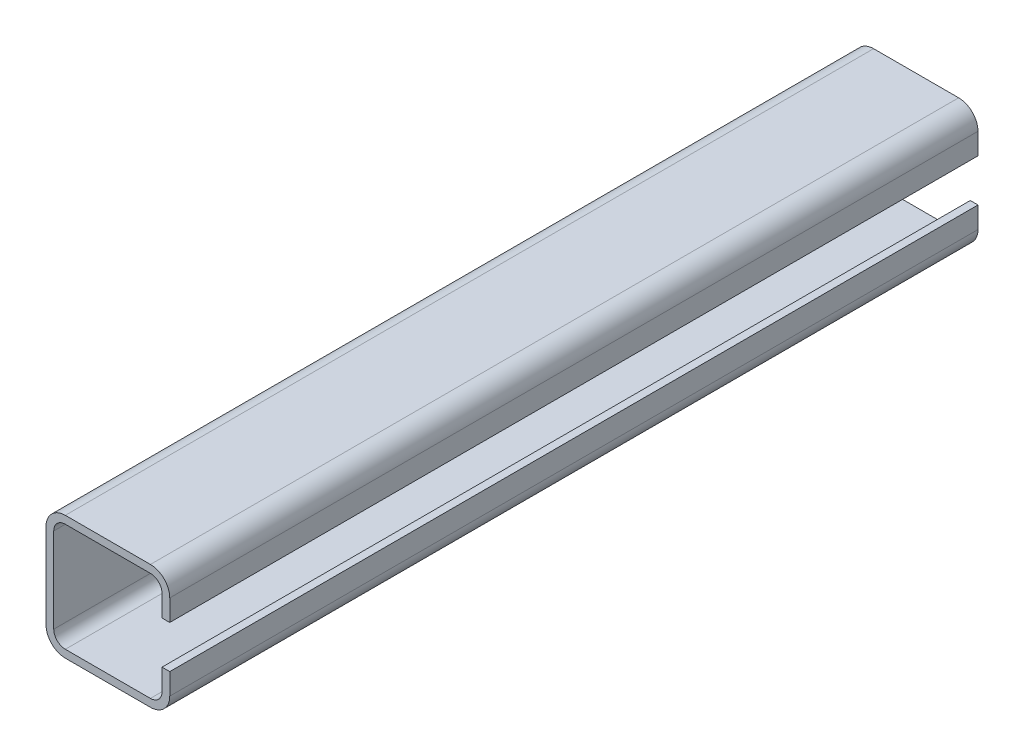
ISO-10303-21;
HEADER;
FILE_DESCRIPTION(('STEP AP214'),'2;1');
FILE_NAME('part.step','',(''),(''),'','','');
FILE_SCHEMA(('AUTOMOTIVE_DESIGN { 1 0 10303 214 1 1 1 1 }'));
ENDSEC;
DATA;
#1=APPLICATION_CONTEXT('core data for automotive mechanical design processes');
#2=APPLICATION_PROTOCOL_DEFINITION('international standard','automotive_design',2000,#1);
#3=PRODUCT_CONTEXT('',#1,'mechanical');
#4=PRODUCT('Part','Part','',(#3));
#5=PRODUCT_RELATED_PRODUCT_CATEGORY('part','',(#4));
#6=PRODUCT_DEFINITION_FORMATION('','',#4);
#7=PRODUCT_DEFINITION_CONTEXT('part definition',#1,'design');
#8=PRODUCT_DEFINITION('design','',#6,#7);
#9=PRODUCT_DEFINITION_SHAPE('','',#8);
#10=(LENGTH_UNIT() NAMED_UNIT(*) SI_UNIT(.MILLI.,.METRE.));
#11=(NAMED_UNIT(*) PLANE_ANGLE_UNIT() SI_UNIT($,.RADIAN.));
#12=(NAMED_UNIT(*) SI_UNIT($,.STERADIAN.) SOLID_ANGLE_UNIT());
#13=UNCERTAINTY_MEASURE_WITH_UNIT(LENGTH_MEASURE(1.E-05),#10,'distance_accuracy_value','');
#14=(GEOMETRIC_REPRESENTATION_CONTEXT(3) GLOBAL_UNCERTAINTY_ASSIGNED_CONTEXT((#13)) GLOBAL_UNIT_ASSIGNED_CONTEXT((#10,
#11,#12)) REPRESENTATION_CONTEXT('',''));
#15=CARTESIAN_POINT('',(0.,0.,0.));
#16=DIRECTION('',(0.,0.,1.));
#17=DIRECTION('',(1.,0.,0.));
#18=AXIS2_PLACEMENT_3D('',#15,#16,#17);
#19=CARTESIAN_POINT('',(-11.,11.,209.));
#20=DIRECTION('',(0.,0.,-1.));
#21=DIRECTION('',(-1.,0.,0.));
#22=AXIS2_PLACEMENT_3D('',#19,#20,#21);
#23=CYLINDRICAL_SURFACE('',#22,5.);
#24=CARTESIAN_POINT('',(-11.,11.,0.));
#25=DIRECTION('',(0.,0.,1.));
#26=DIRECTION('',(-1.,0.,0.));
#27=AXIS2_PLACEMENT_3D('',#24,#25,#26);
#28=CIRCLE('',#27,5.);
#29=CARTESIAN_POINT('',(-11.,16.,0.));
#30=VERTEX_POINT('',#29);
#31=CARTESIAN_POINT('',(-16.,11.,0.));
#32=VERTEX_POINT('',#31);
#33=EDGE_CURVE('E490',#30,#32,#28,.T.);
#34=ORIENTED_EDGE('',*,*,#33,.T.);
#35=DIRECTION('',(0.,0.,-1.));
#36=VECTOR('',#35,1.);
#37=CARTESIAN_POINT('',(-16.,11.,209.));
#38=LINE('',#37,#36);
#39=CARTESIAN_POINT('',(-16.,11.,209.));
#40=VERTEX_POINT('',#39);
#41=EDGE_CURVE('E11',#40,#32,#38,.T.);
#42=ORIENTED_EDGE('',*,*,#41,.F.);
#43=CARTESIAN_POINT('',(-11.,11.,209.));
#44=DIRECTION('',(0.,0.,1.));
#45=DIRECTION('',(-1.,0.,0.));
#46=AXIS2_PLACEMENT_3D('',#43,#44,#45);
#47=CIRCLE('',#46,5.);
#48=CARTESIAN_POINT('',(-11.,16.,209.));
#49=VERTEX_POINT('',#48);
#50=EDGE_CURVE('E541',#49,#40,#47,.T.);
#51=ORIENTED_EDGE('',*,*,#50,.F.);
#52=DIRECTION('',(0.,0.,-1.));
#53=VECTOR('',#52,1.);
#54=CARTESIAN_POINT('',(-11.,16.,209.));
#55=LINE('',#54,#53);
#56=EDGE_CURVE('E503',#49,#30,#55,.T.);
#57=ORIENTED_EDGE('',*,*,#56,.T.);
#58=EDGE_LOOP('',(#34,#42,#51,#57));
#59=FACE_BOUND('',#58,.T.);
#60=ADVANCED_FACE('F350',(#59),#23,.T.);
#61=CARTESIAN_POINT('',(-16.,11.,209.));
#62=DIRECTION('',(1.,0.,0.));
#63=DIRECTION('',(0.,1.,0.));
#64=AXIS2_PLACEMENT_3D('',#61,#62,#63);
#65=PLANE('',#64);
#66=DIRECTION('',(0.,-1.,0.));
#67=VECTOR('',#66,1.);
#68=CARTESIAN_POINT('',(-16.,11.,0.));
#69=LINE('',#68,#67);
#70=CARTESIAN_POINT('',(-16.,-11.,0.));
#71=VERTEX_POINT('',#70);
#72=EDGE_CURVE('E486',#32,#71,#69,.T.);
#73=ORIENTED_EDGE('',*,*,#72,.T.);
#74=DIRECTION('',(0.,0.,-1.));
#75=VECTOR('',#74,1.);
#76=CARTESIAN_POINT('',(-16.,-11.,209.));
#77=LINE('',#76,#75);
#78=CARTESIAN_POINT('',(-16.,-11.,209.));
#79=VERTEX_POINT('',#78);
#80=EDGE_CURVE('E357',#79,#71,#77,.T.);
#81=ORIENTED_EDGE('',*,*,#80,.F.);
#82=DIRECTION('',(0.,-1.,0.));
#83=VECTOR('',#82,1.);
#84=CARTESIAN_POINT('',(-16.,11.,209.));
#85=LINE('',#84,#83);
#86=EDGE_CURVE('E499',#40,#79,#85,.T.);
#87=ORIENTED_EDGE('',*,*,#86,.F.);
#88=ORIENTED_EDGE('',*,*,#41,.T.);
#89=EDGE_LOOP('',(#73,#81,#87,#88));
#90=FACE_BOUND('',#89,.T.);
#91=ADVANCED_FACE('F498',(#90),#65,.F.);
#92=CARTESIAN_POINT('',(-11.,-11.,209.));
#93=DIRECTION('',(0.,0.,-1.));
#94=DIRECTION('',(-1.,0.,0.));
#95=AXIS2_PLACEMENT_3D('',#92,#93,#94);
#96=CYLINDRICAL_SURFACE('',#95,5.);
#97=CARTESIAN_POINT('',(-11.,-11.,0.));
#98=DIRECTION('',(0.,0.,1.));
#99=DIRECTION('',(-1.,0.,0.));
#100=AXIS2_PLACEMENT_3D('',#97,#98,#99);
#101=CIRCLE('',#100,5.);
#102=CARTESIAN_POINT('',(-11.,-16.,0.));
#103=VERTEX_POINT('',#102);
#104=EDGE_CURVE('E492',#71,#103,#101,.T.);
#105=ORIENTED_EDGE('',*,*,#104,.T.);
#106=DIRECTION('',(0.,0.,-1.));
#107=VECTOR('',#106,1.);
#108=CARTESIAN_POINT('',(-11.,-16.,209.));
#109=LINE('',#108,#107);
#110=CARTESIAN_POINT('',(-11.,-16.,209.));
#111=VERTEX_POINT('',#110);
#112=EDGE_CURVE('E627',#111,#103,#109,.T.);
#113=ORIENTED_EDGE('',*,*,#112,.F.);
#114=CARTESIAN_POINT('',(-11.,-11.,209.));
#115=DIRECTION('',(0.,0.,1.));
#116=DIRECTION('',(-1.,0.,0.));
#117=AXIS2_PLACEMENT_3D('',#114,#115,#116);
#118=CIRCLE('',#117,5.);
#119=EDGE_CURVE('E544',#79,#111,#118,.T.);
#120=ORIENTED_EDGE('',*,*,#119,.F.);
#121=ORIENTED_EDGE('',*,*,#80,.T.);
#122=EDGE_LOOP('',(#105,#113,#120,#121));
#123=FACE_BOUND('',#122,.T.);
#124=ADVANCED_FACE('F631',(#123),#96,.T.);
#125=CARTESIAN_POINT('',(-11.,-16.,209.));
#126=DIRECTION('',(0.,1.,0.));
#127=DIRECTION('',(0.,0.,1.));
#128=AXIS2_PLACEMENT_3D('',#125,#126,#127);
#129=PLANE('',#128);
#130=DIRECTION('',(1.,0.,0.));
#131=VECTOR('',#130,1.);
#132=CARTESIAN_POINT('',(-11.,-16.,0.));
#133=LINE('',#132,#131);
#134=CARTESIAN_POINT('',(11.,-16.,0.));
#135=VERTEX_POINT('',#134);
#136=EDGE_CURVE('E507',#103,#135,#133,.T.);
#137=ORIENTED_EDGE('',*,*,#136,.T.);
#138=DIRECTION('',(0.,0.,-1.));
#139=VECTOR('',#138,1.);
#140=CARTESIAN_POINT('',(11.,-16.,209.));
#141=LINE('',#140,#139);
#142=CARTESIAN_POINT('',(11.,-16.,209.));
#143=VERTEX_POINT('',#142);
#144=EDGE_CURVE('E624',#143,#135,#141,.T.);
#145=ORIENTED_EDGE('',*,*,#144,.F.);
#146=DIRECTION('',(1.,0.,0.));
#147=VECTOR('',#146,1.);
#148=CARTESIAN_POINT('',(-11.,-16.,209.));
#149=LINE('',#148,#147);
#150=EDGE_CURVE('E546',#111,#143,#149,.T.);
#151=ORIENTED_EDGE('',*,*,#150,.F.);
#152=ORIENTED_EDGE('',*,*,#112,.T.);
#153=EDGE_LOOP('',(#137,#145,#151,#152));
#154=FACE_BOUND('',#153,.T.);
#155=ADVANCED_FACE('F639',(#154),#129,.F.);
#156=CARTESIAN_POINT('',(11.,-11.,209.));
#157=DIRECTION('',(0.,0.,-1.));
#158=DIRECTION('',(-1.,0.,0.));
#159=AXIS2_PLACEMENT_3D('',#156,#157,#158);
#160=CYLINDRICAL_SURFACE('',#159,5.);
#161=CARTESIAN_POINT('',(11.,-11.,0.));
#162=DIRECTION('',(0.,0.,1.));
#163=DIRECTION('',(-1.,0.,0.));
#164=AXIS2_PLACEMENT_3D('',#161,#162,#163);
#165=CIRCLE('',#164,5.);
#166=CARTESIAN_POINT('',(16.,-11.,0.));
#167=VERTEX_POINT('',#166);
#168=EDGE_CURVE('E509',#135,#167,#165,.T.);
#169=ORIENTED_EDGE('',*,*,#168,.T.);
#170=DIRECTION('',(0.,0.,-1.));
#171=VECTOR('',#170,1.);
#172=CARTESIAN_POINT('',(16.,-11.,209.));
#173=LINE('',#172,#171);
#174=CARTESIAN_POINT('',(16.,-11.,209.));
#175=VERTEX_POINT('',#174);
#176=EDGE_CURVE('E621',#175,#167,#173,.T.);
#177=ORIENTED_EDGE('',*,*,#176,.F.);
#178=CARTESIAN_POINT('',(11.,-11.,209.));
#179=DIRECTION('',(0.,0.,1.));
#180=DIRECTION('',(-1.,0.,0.));
#181=AXIS2_PLACEMENT_3D('',#178,#179,#180);
#182=CIRCLE('',#181,5.);
#183=EDGE_CURVE('E548',#143,#175,#182,.T.);
#184=ORIENTED_EDGE('',*,*,#183,.F.);
#185=ORIENTED_EDGE('',*,*,#144,.T.);
#186=EDGE_LOOP('',(#169,#177,#184,#185));
#187=FACE_BOUND('',#186,.T.);
#188=ADVANCED_FACE('F642',(#187),#160,.T.);
#189=CARTESIAN_POINT('',(16.,-5.5,209.));
#190=DIRECTION('',(-1.,0.,0.));
#191=DIRECTION('',(0.,0.,1.));
#192=AXIS2_PLACEMENT_3D('',#189,#190,#191);
#193=PLANE('',#192);
#194=DIRECTION('',(0.,1.,0.));
#195=VECTOR('',#194,1.);
#196=CARTESIAN_POINT('',(16.,-5.5,0.));
#197=LINE('',#196,#195);
#198=CARTESIAN_POINT('',(16.,-5.5,0.));
#199=VERTEX_POINT('',#198);
#200=EDGE_CURVE('E511',#167,#199,#197,.T.);
#201=ORIENTED_EDGE('',*,*,#200,.T.);
#202=DIRECTION('',(0.,0.,-1.));
#203=VECTOR('',#202,1.);
#204=CARTESIAN_POINT('',(16.,-5.5,209.));
#205=LINE('',#204,#203);
#206=CARTESIAN_POINT('',(16.,-5.5,209.));
#207=VERTEX_POINT('',#206);
#208=EDGE_CURVE('E618',#207,#199,#205,.T.);
#209=ORIENTED_EDGE('',*,*,#208,.F.);
#210=DIRECTION('',(0.,1.,0.));
#211=VECTOR('',#210,1.);
#212=CARTESIAN_POINT('',(16.,-5.5,209.));
#213=LINE('',#212,#211);
#214=EDGE_CURVE('E550',#175,#207,#213,.T.);
#215=ORIENTED_EDGE('',*,*,#214,.F.);
#216=ORIENTED_EDGE('',*,*,#176,.T.);
#217=EDGE_LOOP('',(#201,#209,#215,#216));
#218=FACE_BOUND('',#217,.T.);
#219=ADVANCED_FACE('F647',(#218),#193,.F.);
#220=CARTESIAN_POINT('',(14.,-5.5,209.));
#221=DIRECTION('',(0.,-1.,0.));
#222=DIRECTION('',(0.,0.,-1.));
#223=AXIS2_PLACEMENT_3D('',#220,#221,#222);
#224=PLANE('',#223);
#225=DIRECTION('',(-1.,0.,0.));
#226=VECTOR('',#225,1.);
#227=CARTESIAN_POINT('',(14.,-5.5,0.));
#228=LINE('',#227,#226);
#229=CARTESIAN_POINT('',(14.,-5.5,0.));
#230=VERTEX_POINT('',#229);
#231=EDGE_CURVE('E513',#199,#230,#228,.T.);
#232=ORIENTED_EDGE('',*,*,#231,.T.);
#233=DIRECTION('',(0.,0.,-1.));
#234=VECTOR('',#233,1.);
#235=CARTESIAN_POINT('',(14.,-5.5,209.));
#236=LINE('',#235,#234);
#237=CARTESIAN_POINT('',(14.,-5.5,209.));
#238=VERTEX_POINT('',#237);
#239=EDGE_CURVE('E615',#238,#230,#236,.T.);
#240=ORIENTED_EDGE('',*,*,#239,.F.);
#241=DIRECTION('',(-1.,0.,0.));
#242=VECTOR('',#241,1.);
#243=CARTESIAN_POINT('',(14.,-5.5,209.));
#244=LINE('',#243,#242);
#245=EDGE_CURVE('E552',#207,#238,#244,.T.);
#246=ORIENTED_EDGE('',*,*,#245,.F.);
#247=ORIENTED_EDGE('',*,*,#208,.T.);
#248=EDGE_LOOP('',(#232,#240,#246,#247));
#249=FACE_BOUND('',#248,.T.);
#250=ADVANCED_FACE('F653',(#249),#224,.F.);
#251=CARTESIAN_POINT('',(14.,-5.5,209.));
#252=DIRECTION('',(1.,0.,0.));
#253=DIRECTION('',(0.,0.,-1.));
#254=AXIS2_PLACEMENT_3D('',#251,#252,#253);
#255=PLANE('',#254);
#256=DIRECTION('',(0.,-1.,0.));
#257=VECTOR('',#256,1.);
#258=CARTESIAN_POINT('',(14.,-5.5,0.));
#259=LINE('',#258,#257);
#260=CARTESIAN_POINT('',(14.,-11.,0.));
#261=VERTEX_POINT('',#260);
#262=EDGE_CURVE('E515',#230,#261,#259,.T.);
#263=ORIENTED_EDGE('',*,*,#262,.T.);
#264=DIRECTION('',(0.,0.,-1.));
#265=VECTOR('',#264,1.);
#266=CARTESIAN_POINT('',(14.,-11.,209.));
#267=LINE('',#266,#265);
#268=CARTESIAN_POINT('',(14.,-11.,209.));
#269=VERTEX_POINT('',#268);
#270=EDGE_CURVE('E612',#269,#261,#267,.T.);
#271=ORIENTED_EDGE('',*,*,#270,.F.);
#272=DIRECTION('',(0.,-1.,0.));
#273=VECTOR('',#272,1.);
#274=CARTESIAN_POINT('',(14.,-5.5,209.));
#275=LINE('',#274,#273);
#276=EDGE_CURVE('E554',#238,#269,#275,.T.);
#277=ORIENTED_EDGE('',*,*,#276,.F.);
#278=ORIENTED_EDGE('',*,*,#239,.T.);
#279=EDGE_LOOP('',(#263,#271,#277,#278));
#280=FACE_BOUND('',#279,.T.);
#281=ADVANCED_FACE('F657',(#280),#255,.F.);
#282=CARTESIAN_POINT('',(11.,-11.,209.));
#283=DIRECTION('',(0.,0.,-1.));
#284=DIRECTION('',(-1.,0.,0.));
#285=AXIS2_PLACEMENT_3D('',#282,#283,#284);
#286=CYLINDRICAL_SURFACE('',#285,3.);
#287=CARTESIAN_POINT('',(11.,-11.,0.));
#288=DIRECTION('',(0.,0.,-1.));
#289=DIRECTION('',(-1.,0.,0.));
#290=AXIS2_PLACEMENT_3D('',#287,#288,#289);
#291=CIRCLE('',#290,3.);
#292=CARTESIAN_POINT('',(11.,-14.,0.));
#293=VERTEX_POINT('',#292);
#294=EDGE_CURVE('E517',#261,#293,#291,.T.);
#295=ORIENTED_EDGE('',*,*,#294,.T.);
#296=DIRECTION('',(0.,0.,-1.));
#297=VECTOR('',#296,1.);
#298=CARTESIAN_POINT('',(11.,-14.,209.));
#299=LINE('',#298,#297);
#300=CARTESIAN_POINT('',(11.,-14.,209.));
#301=VERTEX_POINT('',#300);
#302=EDGE_CURVE('E609',#301,#293,#299,.T.);
#303=ORIENTED_EDGE('',*,*,#302,.F.);
#304=CARTESIAN_POINT('',(11.,-11.,209.));
#305=DIRECTION('',(0.,0.,-1.));
#306=DIRECTION('',(-1.,0.,0.));
#307=AXIS2_PLACEMENT_3D('',#304,#305,#306);
#308=CIRCLE('',#307,3.);
#309=EDGE_CURVE('E556',#269,#301,#308,.T.);
#310=ORIENTED_EDGE('',*,*,#309,.F.);
#311=ORIENTED_EDGE('',*,*,#270,.T.);
#312=EDGE_LOOP('',(#295,#303,#310,#311));
#313=FACE_BOUND('',#312,.T.);
#314=ADVANCED_FACE('F662',(#313),#286,.F.);
#315=CARTESIAN_POINT('',(-11.,-14.,209.));
#316=DIRECTION('',(0.,-1.,0.));
#317=DIRECTION('',(0.,0.,-1.));
#318=AXIS2_PLACEMENT_3D('',#315,#316,#317);
#319=PLANE('',#318);
#320=DIRECTION('',(-1.,0.,0.));
#321=VECTOR('',#320,1.);
#322=CARTESIAN_POINT('',(-11.,-14.,0.));
#323=LINE('',#322,#321);
#324=CARTESIAN_POINT('',(-11.,-14.,0.));
#325=VERTEX_POINT('',#324);
#326=EDGE_CURVE('E519',#293,#325,#323,.T.);
#327=ORIENTED_EDGE('',*,*,#326,.T.);
#328=DIRECTION('',(0.,0.,-1.));
#329=VECTOR('',#328,1.);
#330=CARTESIAN_POINT('',(-11.,-14.,209.));
#331=LINE('',#330,#329);
#332=CARTESIAN_POINT('',(-11.,-14.,209.));
#333=VERTEX_POINT('',#332);
#334=EDGE_CURVE('E606',#333,#325,#331,.T.);
#335=ORIENTED_EDGE('',*,*,#334,.F.);
#336=DIRECTION('',(-1.,0.,0.));
#337=VECTOR('',#336,1.);
#338=CARTESIAN_POINT('',(-11.,-14.,209.));
#339=LINE('',#338,#337);
#340=EDGE_CURVE('E558',#301,#333,#339,.T.);
#341=ORIENTED_EDGE('',*,*,#340,.F.);
#342=ORIENTED_EDGE('',*,*,#302,.T.);
#343=EDGE_LOOP('',(#327,#335,#341,#342));
#344=FACE_BOUND('',#343,.T.);
#345=ADVANCED_FACE('F668',(#344),#319,.F.);
#346=CARTESIAN_POINT('',(-11.,-11.,209.));
#347=DIRECTION('',(0.,0.,-1.));
#348=DIRECTION('',(-1.,0.,0.));
#349=AXIS2_PLACEMENT_3D('',#346,#347,#348);
#350=CYLINDRICAL_SURFACE('',#349,3.);
#351=CARTESIAN_POINT('',(-11.,-11.,0.));
#352=DIRECTION('',(0.,0.,-1.));
#353=DIRECTION('',(-1.,0.,0.));
#354=AXIS2_PLACEMENT_3D('',#351,#352,#353);
#355=CIRCLE('',#354,3.);
#356=CARTESIAN_POINT('',(-14.,-11.,0.));
#357=VERTEX_POINT('',#356);
#358=EDGE_CURVE('E521',#325,#357,#355,.T.);
#359=ORIENTED_EDGE('',*,*,#358,.T.);
#360=DIRECTION('',(0.,0.,-1.));
#361=VECTOR('',#360,1.);
#362=CARTESIAN_POINT('',(-14.,-11.,209.));
#363=LINE('',#362,#361);
#364=CARTESIAN_POINT('',(-14.,-11.,209.));
#365=VERTEX_POINT('',#364);
#366=EDGE_CURVE('E603',#365,#357,#363,.T.);
#367=ORIENTED_EDGE('',*,*,#366,.F.);
#368=CARTESIAN_POINT('',(-11.,-11.,209.));
#369=DIRECTION('',(0.,0.,-1.));
#370=DIRECTION('',(-1.,0.,0.));
#371=AXIS2_PLACEMENT_3D('',#368,#369,#370);
#372=CIRCLE('',#371,3.);
#373=EDGE_CURVE('E560',#333,#365,#372,.T.);
#374=ORIENTED_EDGE('',*,*,#373,.F.);
#375=ORIENTED_EDGE('',*,*,#334,.T.);
#376=EDGE_LOOP('',(#359,#367,#374,#375));
#377=FACE_BOUND('',#376,.T.);
#378=ADVANCED_FACE('F672',(#377),#350,.F.);
#379=CARTESIAN_POINT('',(-14.,11.,209.));
#380=DIRECTION('',(-1.,0.,0.));
#381=DIRECTION('',(0.,-1.,0.));
#382=AXIS2_PLACEMENT_3D('',#379,#380,#381);
#383=PLANE('',#382);
#384=DIRECTION('',(0.,1.,0.));
#385=VECTOR('',#384,1.);
#386=CARTESIAN_POINT('',(-14.,11.,0.));
#387=LINE('',#386,#385);
#388=CARTESIAN_POINT('',(-14.,11.,0.));
#389=VERTEX_POINT('',#388);
#390=EDGE_CURVE('E523',#357,#389,#387,.T.);
#391=ORIENTED_EDGE('',*,*,#390,.T.);
#392=DIRECTION('',(0.,0.,-1.));
#393=VECTOR('',#392,1.);
#394=CARTESIAN_POINT('',(-14.,11.,209.));
#395=LINE('',#394,#393);
#396=CARTESIAN_POINT('',(-14.,11.,209.));
#397=VERTEX_POINT('',#396);
#398=EDGE_CURVE('E600',#397,#389,#395,.T.);
#399=ORIENTED_EDGE('',*,*,#398,.F.);
#400=DIRECTION('',(0.,1.,0.));
#401=VECTOR('',#400,1.);
#402=CARTESIAN_POINT('',(-14.,11.,209.));
#403=LINE('',#402,#401);
#404=EDGE_CURVE('E562',#365,#397,#403,.T.);
#405=ORIENTED_EDGE('',*,*,#404,.F.);
#406=ORIENTED_EDGE('',*,*,#366,.T.);
#407=EDGE_LOOP('',(#391,#399,#405,#406));
#408=FACE_BOUND('',#407,.T.);
#409=ADVANCED_FACE('F677',(#408),#383,.F.);
#410=CARTESIAN_POINT('',(-11.,11.,209.));
#411=DIRECTION('',(0.,0.,-1.));
#412=DIRECTION('',(-1.,0.,0.));
#413=AXIS2_PLACEMENT_3D('',#410,#411,#412);
#414=CYLINDRICAL_SURFACE('',#413,3.);
#415=CARTESIAN_POINT('',(-11.,11.,0.));
#416=DIRECTION('',(0.,0.,-1.));
#417=DIRECTION('',(-1.,0.,0.));
#418=AXIS2_PLACEMENT_3D('',#415,#416,#417);
#419=CIRCLE('',#418,3.);
#420=CARTESIAN_POINT('',(-11.,14.,0.));
#421=VERTEX_POINT('',#420);
#422=EDGE_CURVE('E525',#389,#421,#419,.T.);
#423=ORIENTED_EDGE('',*,*,#422,.T.);
#424=DIRECTION('',(0.,0.,-1.));
#425=VECTOR('',#424,1.);
#426=CARTESIAN_POINT('',(-11.,14.,209.));
#427=LINE('',#426,#425);
#428=CARTESIAN_POINT('',(-11.,14.,209.));
#429=VERTEX_POINT('',#428);
#430=EDGE_CURVE('E597',#429,#421,#427,.T.);
#431=ORIENTED_EDGE('',*,*,#430,.F.);
#432=CARTESIAN_POINT('',(-11.,11.,209.));
#433=DIRECTION('',(0.,0.,-1.));
#434=DIRECTION('',(-1.,0.,0.));
#435=AXIS2_PLACEMENT_3D('',#432,#433,#434);
#436=CIRCLE('',#435,3.);
#437=EDGE_CURVE('E564',#397,#429,#436,.T.);
#438=ORIENTED_EDGE('',*,*,#437,.F.);
#439=ORIENTED_EDGE('',*,*,#398,.T.);
#440=EDGE_LOOP('',(#423,#431,#438,#439));
#441=FACE_BOUND('',#440,.T.);
#442=ADVANCED_FACE('F683',(#441),#414,.F.);
#443=CARTESIAN_POINT('',(-11.,14.,209.));
#444=DIRECTION('',(0.,1.,0.));
#445=DIRECTION('',(0.,0.,1.));
#446=AXIS2_PLACEMENT_3D('',#443,#444,#445);
#447=PLANE('',#446);
#448=DIRECTION('',(1.,0.,0.));
#449=VECTOR('',#448,1.);
#450=CARTESIAN_POINT('',(-11.,14.,0.));
#451=LINE('',#450,#449);
#452=CARTESIAN_POINT('',(11.,14.,0.));
#453=VERTEX_POINT('',#452);
#454=EDGE_CURVE('E527',#421,#453,#451,.T.);
#455=ORIENTED_EDGE('',*,*,#454,.T.);
#456=DIRECTION('',(0.,0.,-1.));
#457=VECTOR('',#456,1.);
#458=CARTESIAN_POINT('',(11.,14.,209.));
#459=LINE('',#458,#457);
#460=CARTESIAN_POINT('',(11.,14.,209.));
#461=VERTEX_POINT('',#460);
#462=EDGE_CURVE('E594',#461,#453,#459,.T.);
#463=ORIENTED_EDGE('',*,*,#462,.F.);
#464=DIRECTION('',(1.,0.,0.));
#465=VECTOR('',#464,1.);
#466=CARTESIAN_POINT('',(-11.,14.,209.));
#467=LINE('',#466,#465);
#468=EDGE_CURVE('E566',#429,#461,#467,.T.);
#469=ORIENTED_EDGE('',*,*,#468,.F.);
#470=ORIENTED_EDGE('',*,*,#430,.T.);
#471=EDGE_LOOP('',(#455,#463,#469,#470));
#472=FACE_BOUND('',#471,.T.);
#473=ADVANCED_FACE('F687',(#472),#447,.F.);
#474=CARTESIAN_POINT('',(11.,11.,209.));
#475=DIRECTION('',(0.,0.,-1.));
#476=DIRECTION('',(-1.,0.,0.));
#477=AXIS2_PLACEMENT_3D('',#474,#475,#476);
#478=CYLINDRICAL_SURFACE('',#477,3.);
#479=CARTESIAN_POINT('',(11.,11.,0.));
#480=DIRECTION('',(0.,0.,-1.));
#481=DIRECTION('',(-1.,0.,0.));
#482=AXIS2_PLACEMENT_3D('',#479,#480,#481);
#483=CIRCLE('',#482,3.);
#484=CARTESIAN_POINT('',(14.,11.,0.));
#485=VERTEX_POINT('',#484);
#486=EDGE_CURVE('E529',#453,#485,#483,.T.);
#487=ORIENTED_EDGE('',*,*,#486,.T.);
#488=DIRECTION('',(0.,0.,-1.));
#489=VECTOR('',#488,1.);
#490=CARTESIAN_POINT('',(14.,11.,209.));
#491=LINE('',#490,#489);
#492=CARTESIAN_POINT('',(14.,11.,209.));
#493=VERTEX_POINT('',#492);
#494=EDGE_CURVE('E591',#493,#485,#491,.T.);
#495=ORIENTED_EDGE('',*,*,#494,.F.);
#496=CARTESIAN_POINT('',(11.,11.,209.));
#497=DIRECTION('',(0.,0.,-1.));
#498=DIRECTION('',(-1.,0.,0.));
#499=AXIS2_PLACEMENT_3D('',#496,#497,#498);
#500=CIRCLE('',#499,3.);
#501=EDGE_CURVE('E568',#461,#493,#500,.T.);
#502=ORIENTED_EDGE('',*,*,#501,.F.);
#503=ORIENTED_EDGE('',*,*,#462,.T.);
#504=EDGE_LOOP('',(#487,#495,#502,#503));
#505=FACE_BOUND('',#504,.T.);
#506=ADVANCED_FACE('F692',(#505),#478,.F.);
#507=CARTESIAN_POINT('',(14.,11.,209.));
#508=DIRECTION('',(1.,0.,0.));
#509=DIRECTION('',(0.,0.,-1.));
#510=AXIS2_PLACEMENT_3D('',#507,#508,#509);
#511=PLANE('',#510);
#512=DIRECTION('',(0.,-1.,0.));
#513=VECTOR('',#512,1.);
#514=CARTESIAN_POINT('',(14.,11.,0.));
#515=LINE('',#514,#513);
#516=CARTESIAN_POINT('',(14.,5.5,0.));
#517=VERTEX_POINT('',#516);
#518=EDGE_CURVE('E531',#485,#517,#515,.T.);
#519=ORIENTED_EDGE('',*,*,#518,.T.);
#520=DIRECTION('',(0.,0.,-1.));
#521=VECTOR('',#520,1.);
#522=CARTESIAN_POINT('',(14.,5.5,209.));
#523=LINE('',#522,#521);
#524=CARTESIAN_POINT('',(14.,5.5,209.));
#525=VERTEX_POINT('',#524);
#526=EDGE_CURVE('E588',#525,#517,#523,.T.);
#527=ORIENTED_EDGE('',*,*,#526,.F.);
#528=DIRECTION('',(0.,-1.,0.));
#529=VECTOR('',#528,1.);
#530=CARTESIAN_POINT('',(14.,11.,209.));
#531=LINE('',#530,#529);
#532=EDGE_CURVE('E570',#493,#525,#531,.T.);
#533=ORIENTED_EDGE('',*,*,#532,.F.);
#534=ORIENTED_EDGE('',*,*,#494,.T.);
#535=EDGE_LOOP('',(#519,#527,#533,#534));
#536=FACE_BOUND('',#535,.T.);
#537=ADVANCED_FACE('F698',(#536),#511,.F.);
#538=CARTESIAN_POINT('',(14.,5.5,209.));
#539=DIRECTION('',(0.,1.,0.));
#540=DIRECTION('',(0.,0.,1.));
#541=AXIS2_PLACEMENT_3D('',#538,#539,#540);
#542=PLANE('',#541);
#543=DIRECTION('',(1.,0.,0.));
#544=VECTOR('',#543,1.);
#545=CARTESIAN_POINT('',(14.,5.5,0.));
#546=LINE('',#545,#544);
#547=CARTESIAN_POINT('',(16.,5.5,0.));
#548=VERTEX_POINT('',#547);
#549=EDGE_CURVE('E533',#517,#548,#546,.T.);
#550=ORIENTED_EDGE('',*,*,#549,.T.);
#551=DIRECTION('',(0.,0.,-1.));
#552=VECTOR('',#551,1.);
#553=CARTESIAN_POINT('',(16.,5.5,209.));
#554=LINE('',#553,#552);
#555=CARTESIAN_POINT('',(16.,5.5,209.));
#556=VERTEX_POINT('',#555);
#557=EDGE_CURVE('E585',#556,#548,#554,.T.);
#558=ORIENTED_EDGE('',*,*,#557,.F.);
#559=DIRECTION('',(1.,0.,0.));
#560=VECTOR('',#559,1.);
#561=CARTESIAN_POINT('',(14.,5.5,209.));
#562=LINE('',#561,#560);
#563=EDGE_CURVE('E572',#525,#556,#562,.T.);
#564=ORIENTED_EDGE('',*,*,#563,.F.);
#565=ORIENTED_EDGE('',*,*,#526,.T.);
#566=EDGE_LOOP('',(#550,#558,#564,#565));
#567=FACE_BOUND('',#566,.T.);
#568=ADVANCED_FACE('F702',(#567),#542,.F.);
#569=CARTESIAN_POINT('',(16.,11.,209.));
#570=DIRECTION('',(-1.,0.,0.));
#571=DIRECTION('',(0.,-1.,0.));
#572=AXIS2_PLACEMENT_3D('',#569,#570,#571);
#573=PLANE('',#572);
#574=DIRECTION('',(0.,1.,0.));
#575=VECTOR('',#574,1.);
#576=CARTESIAN_POINT('',(16.,11.,0.));
#577=LINE('',#576,#575);
#578=CARTESIAN_POINT('',(16.,11.,0.));
#579=VERTEX_POINT('',#578);
#580=EDGE_CURVE('E535',#548,#579,#577,.T.);
#581=ORIENTED_EDGE('',*,*,#580,.T.);
#582=DIRECTION('',(0.,0.,-1.));
#583=VECTOR('',#582,1.);
#584=CARTESIAN_POINT('',(16.,11.,209.));
#585=LINE('',#584,#583);
#586=CARTESIAN_POINT('',(16.,11.,209.));
#587=VERTEX_POINT('',#586);
#588=EDGE_CURVE('E582',#587,#579,#585,.T.);
#589=ORIENTED_EDGE('',*,*,#588,.F.);
#590=DIRECTION('',(0.,1.,0.));
#591=VECTOR('',#590,1.);
#592=CARTESIAN_POINT('',(16.,11.,209.));
#593=LINE('',#592,#591);
#594=EDGE_CURVE('E574',#556,#587,#593,.T.);
#595=ORIENTED_EDGE('',*,*,#594,.F.);
#596=ORIENTED_EDGE('',*,*,#557,.T.);
#597=EDGE_LOOP('',(#581,#589,#595,#596));
#598=FACE_BOUND('',#597,.T.);
#599=ADVANCED_FACE('F707',(#598),#573,.F.);
#600=CARTESIAN_POINT('',(11.,11.,209.));
#601=DIRECTION('',(0.,0.,-1.));
#602=DIRECTION('',(-1.,0.,0.));
#603=AXIS2_PLACEMENT_3D('',#600,#601,#602);
#604=CYLINDRICAL_SURFACE('',#603,5.);
#605=CARTESIAN_POINT('',(11.,11.,0.));
#606=DIRECTION('',(0.,0.,1.));
#607=DIRECTION('',(-1.,0.,0.));
#608=AXIS2_PLACEMENT_3D('',#605,#606,#607);
#609=CIRCLE('',#608,5.);
#610=CARTESIAN_POINT('',(11.,16.,0.));
#611=VERTEX_POINT('',#610);
#612=EDGE_CURVE('E537',#579,#611,#609,.T.);
#613=ORIENTED_EDGE('',*,*,#612,.T.);
#614=DIRECTION('',(0.,0.,-1.));
#615=VECTOR('',#614,1.);
#616=CARTESIAN_POINT('',(11.,16.,209.));
#617=LINE('',#616,#615);
#618=CARTESIAN_POINT('',(11.,16.,209.));
#619=VERTEX_POINT('',#618);
#620=EDGE_CURVE('E579',#619,#611,#617,.T.);
#621=ORIENTED_EDGE('',*,*,#620,.F.);
#622=CARTESIAN_POINT('',(11.,11.,209.));
#623=DIRECTION('',(0.,0.,1.));
#624=DIRECTION('',(-1.,0.,0.));
#625=AXIS2_PLACEMENT_3D('',#622,#623,#624);
#626=CIRCLE('',#625,5.);
#627=EDGE_CURVE('E369',#587,#619,#626,.T.);
#628=ORIENTED_EDGE('',*,*,#627,.F.);
#629=ORIENTED_EDGE('',*,*,#588,.T.);
#630=EDGE_LOOP('',(#613,#621,#628,#629));
#631=FACE_BOUND('',#630,.T.);
#632=ADVANCED_FACE('F710',(#631),#604,.T.);
#633=CARTESIAN_POINT('',(-11.,16.,209.));
#634=DIRECTION('',(0.,-1.,0.));
#635=DIRECTION('',(0.,0.,-1.));
#636=AXIS2_PLACEMENT_3D('',#633,#634,#635);
#637=PLANE('',#636);
#638=DIRECTION('',(-1.,0.,0.));
#639=VECTOR('',#638,1.);
#640=CARTESIAN_POINT('',(-11.,16.,0.));
#641=LINE('',#640,#639);
#642=EDGE_CURVE('E539',#611,#30,#641,.T.);
#643=ORIENTED_EDGE('',*,*,#642,.T.);
#644=ORIENTED_EDGE('',*,*,#56,.F.);
#645=DIRECTION('',(-1.,0.,0.));
#646=VECTOR('',#645,1.);
#647=CARTESIAN_POINT('',(-11.,16.,209.));
#648=LINE('',#647,#646);
#649=EDGE_CURVE('E364',#619,#49,#648,.T.);
#650=ORIENTED_EDGE('',*,*,#649,.F.);
#651=ORIENTED_EDGE('',*,*,#620,.T.);
#652=EDGE_LOOP('',(#643,#644,#650,#651));
#653=FACE_BOUND('',#652,.T.);
#654=ADVANCED_FACE('F712',(#653),#637,.F.);
#655=CARTESIAN_POINT('',(-11.,11.,209.));
#656=DIRECTION('',(0.,0.,-1.));
#657=DIRECTION('',(-1.,0.,0.));
#658=AXIS2_PLACEMENT_3D('',#655,#656,#657);
#659=PLANE('',#658);
#660=ORIENTED_EDGE('',*,*,#50,.T.);
#661=ORIENTED_EDGE('',*,*,#86,.T.);
#662=ORIENTED_EDGE('',*,*,#119,.T.);
#663=ORIENTED_EDGE('',*,*,#150,.T.);
#664=ORIENTED_EDGE('',*,*,#183,.T.);
#665=ORIENTED_EDGE('',*,*,#214,.T.);
#666=ORIENTED_EDGE('',*,*,#245,.T.);
#667=ORIENTED_EDGE('',*,*,#276,.T.);
#668=ORIENTED_EDGE('',*,*,#309,.T.);
#669=ORIENTED_EDGE('',*,*,#340,.T.);
#670=ORIENTED_EDGE('',*,*,#373,.T.);
#671=ORIENTED_EDGE('',*,*,#404,.T.);
#672=ORIENTED_EDGE('',*,*,#437,.T.);
#673=ORIENTED_EDGE('',*,*,#468,.T.);
#674=ORIENTED_EDGE('',*,*,#501,.T.);
#675=ORIENTED_EDGE('',*,*,#532,.T.);
#676=ORIENTED_EDGE('',*,*,#563,.T.);
#677=ORIENTED_EDGE('',*,*,#594,.T.);
#678=ORIENTED_EDGE('',*,*,#627,.T.);
#679=ORIENTED_EDGE('',*,*,#649,.T.);
#680=EDGE_LOOP('',(#660,#661,#662,#663,#664,#665,#666,#667,#668,#669,#670,#671,#672,#673,#674,
#675,#676,#677,#678,#679));
#681=FACE_BOUND('',#680,.T.);
#682=ADVANCED_FACE('F634',(#681),#659,.F.);
#683=CARTESIAN_POINT('',(-11.,11.,0.));
#684=DIRECTION('',(0.,0.,-1.));
#685=DIRECTION('',(-1.,0.,0.));
#686=AXIS2_PLACEMENT_3D('',#683,#684,#685);
#687=PLANE('',#686);
#688=ORIENTED_EDGE('',*,*,#33,.F.);
#689=ORIENTED_EDGE('',*,*,#642,.F.);
#690=ORIENTED_EDGE('',*,*,#612,.F.);
#691=ORIENTED_EDGE('',*,*,#580,.F.);
#692=ORIENTED_EDGE('',*,*,#549,.F.);
#693=ORIENTED_EDGE('',*,*,#518,.F.);
#694=ORIENTED_EDGE('',*,*,#486,.F.);
#695=ORIENTED_EDGE('',*,*,#454,.F.);
#696=ORIENTED_EDGE('',*,*,#422,.F.);
#697=ORIENTED_EDGE('',*,*,#390,.F.);
#698=ORIENTED_EDGE('',*,*,#358,.F.);
#699=ORIENTED_EDGE('',*,*,#326,.F.);
#700=ORIENTED_EDGE('',*,*,#294,.F.);
#701=ORIENTED_EDGE('',*,*,#262,.F.);
#702=ORIENTED_EDGE('',*,*,#231,.F.);
#703=ORIENTED_EDGE('',*,*,#200,.F.);
#704=ORIENTED_EDGE('',*,*,#168,.F.);
#705=ORIENTED_EDGE('',*,*,#136,.F.);
#706=ORIENTED_EDGE('',*,*,#104,.F.);
#707=ORIENTED_EDGE('',*,*,#72,.F.);
#708=EDGE_LOOP('',(#688,#689,#690,#691,#692,#693,#694,#695,#696,#697,#698,#699,#700,#701,#702,
#703,#704,#705,#706,#707));
#709=FACE_BOUND('',#708,.T.);
#710=ADVANCED_FACE('F487',(#709),#687,.T.);
#711=CLOSED_SHELL('',(#60,#91,#124,#155,#188,#219,#250,#281,#314,#345,#378,#409,#442,#473,#506,
#537,#568,#599,#632,#654,#682,#710));
#712=MANIFOLD_SOLID_BREP('B2',#711);
#713=ADVANCED_BREP_SHAPE_REPRESENTATION('',(#18,#712),#14);
#714=SHAPE_DEFINITION_REPRESENTATION(#9,#713);
ENDSEC;
END-ISO-10303-21;
